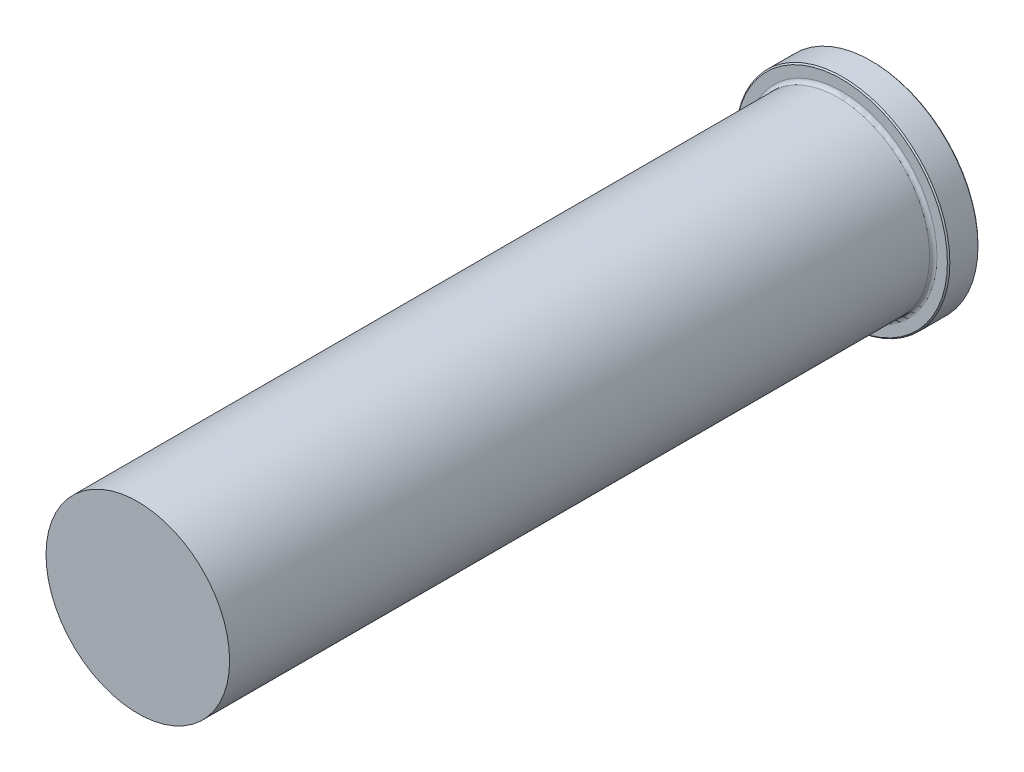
from build123d import *

# Parameters (mm, degrees)
FILLET1_R     = 0.762
CHAMFER1_SIZE = 0.254


with BuildPart() as part:
    # Sketch1 → Revolve1 (revolve)
    with BuildSketch(Plane(origin=(0, 0, 0), x_dir=(0, 0, -1), z_dir=(1, 0, 0)), mode=Mode.PRIVATE) as revolve1_sk:
        Polygon((0, 0), (0, 22.225), (-6.35, 22.225), (-6.35, 19.05), (-152.4, 19.05), (-152.4, 0), align=None)
    revolve(revolve1_sk.sketch.rotate(Axis((0, 0, 0), (0, 0, 1)), 90), axis=Axis((0, 0, 0), (0, 0, 1)))

    # Fillet1
    fillet1_edges = [part.edges().sort_by_distance(p)[0] for p in [
        (19.05, 0, 6.35),
    ]]
    fillet(fillet1_edges, radius=FILLET1_R)

    # Chamfer1
    chamfer1_edges = [part.edges().sort_by_distance(p)[0] for p in [
        (22.225, 0, 6.35),
        (22.225, 0, 0),
    ]]
    chamfer(chamfer1_edges, length=CHAMFER1_SIZE)


solid = part.part
